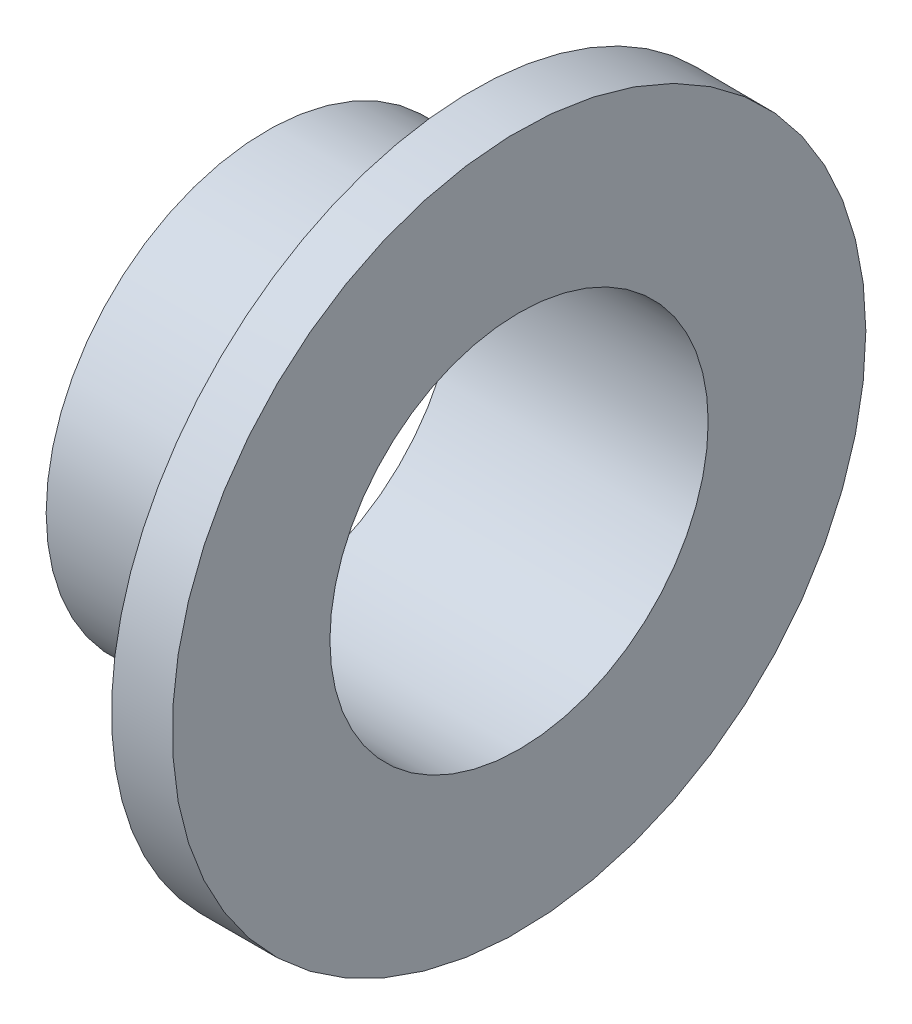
ISO-10303-21;
HEADER;
FILE_DESCRIPTION(('STEP AP214'),'2;1');
FILE_NAME('part.step','',(''),(''),'','','');
FILE_SCHEMA(('AUTOMOTIVE_DESIGN { 1 0 10303 214 1 1 1 1 }'));
ENDSEC;
DATA;
#1=APPLICATION_CONTEXT('core data for automotive mechanical design processes');
#2=APPLICATION_PROTOCOL_DEFINITION('international standard','automotive_design',2000,#1);
#3=PRODUCT_CONTEXT('',#1,'mechanical');
#4=PRODUCT('Part','Part','',(#3));
#5=PRODUCT_RELATED_PRODUCT_CATEGORY('part','',(#4));
#6=PRODUCT_DEFINITION_FORMATION('','',#4);
#7=PRODUCT_DEFINITION_CONTEXT('part definition',#1,'design');
#8=PRODUCT_DEFINITION('design','',#6,#7);
#9=PRODUCT_DEFINITION_SHAPE('','',#8);
#10=(LENGTH_UNIT() NAMED_UNIT(*) SI_UNIT(.MILLI.,.METRE.));
#11=(NAMED_UNIT(*) PLANE_ANGLE_UNIT() SI_UNIT($,.RADIAN.));
#12=(NAMED_UNIT(*) SI_UNIT($,.STERADIAN.) SOLID_ANGLE_UNIT());
#13=UNCERTAINTY_MEASURE_WITH_UNIT(LENGTH_MEASURE(1.E-05),#10,'distance_accuracy_value','');
#14=(GEOMETRIC_REPRESENTATION_CONTEXT(3) GLOBAL_UNCERTAINTY_ASSIGNED_CONTEXT((#13)) GLOBAL_UNIT_ASSIGNED_CONTEXT((#10,
#11,#12)) REPRESENTATION_CONTEXT('',''));
#15=CARTESIAN_POINT('',(0.,0.,0.));
#16=DIRECTION('',(0.,0.,1.));
#17=DIRECTION('',(1.,0.,0.));
#18=AXIS2_PLACEMENT_3D('',#15,#16,#17);
#19=CARTESIAN_POINT('',(25.,132.470854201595,85.6274699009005));
#20=CARTESIAN_POINT('',(14.,-18.7285643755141,-58.4387331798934));
#21=CARTESIAN_POINT('',(13.89,-20.2405585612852,-59.8793952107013));
#22=CARTESIAN_POINT('',(25.,127.69616434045,92.4573147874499));
#23=CARTESIAN_POINT('',(14.,-25.2627996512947,-50.8688078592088));
#24=CARTESIAN_POINT('',(13.89,-26.7923892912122,-52.3020690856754));
#25=CARTESIAN_POINT('',(25.,122.921474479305,99.2871596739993));
#26=CARTESIAN_POINT('',(14.,-31.7970349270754,-43.2988825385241));
#27=CARTESIAN_POINT('',(13.89,-33.3442200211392,-44.7247429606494));
#28=CARTESIAN_POINT('',(25.,113.372094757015,112.946849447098));
#29=CARTESIAN_POINT('',(14.,-44.8655054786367,-28.1590318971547));
#30=CARTESIAN_POINT('',(13.89,-46.4478814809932,-29.5700907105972));
#31=CARTESIAN_POINT('',(25.,108.597404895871,119.776694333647));
#32=CARTESIAN_POINT('',(14.,-51.3997407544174,-20.58910657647));
#33=CARTESIAN_POINT('',(13.89,-52.9997122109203,-21.9927645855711));
#34=CARTESIAN_POINT('',(25.,103.822715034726,126.606539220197));
#35=CARTESIAN_POINT('',(14.,-57.9339760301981,-13.0191812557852));
#36=CARTESIAN_POINT('',(13.89,-59.5515429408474,-14.415438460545));
#37=B_SPLINE_SURFACE_WITH_KNOTS('',3,1,((#19,#20,#21),(#22,#23,#24),(#25,#26,#27),(#28,#29,#30),
(#31,#32,#33),(#34,#35,#36)),.UNSPECIFIED.,.F.,.F.,.F.,(4,2,4),(2,1,2),(0.,0.5,1.),(0.,1.,1.01),.UNSPECIFIED.);
#38=CARTESIAN_POINT('',(16.3608662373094,0.,-11.));
#39=CARTESIAN_POINT('',(16.3484428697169,-0.30880988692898,-11.0000022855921));
#40=CARTESIAN_POINT('',(16.3364586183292,-0.617600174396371,-10.9869906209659));
#41=CARTESIAN_POINT('',(16.3134465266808,-1.23312722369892,-10.9350258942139));
#42=CARTESIAN_POINT('',(16.3024189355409,-1.53986343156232,-10.8960660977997));
#43=CARTESIAN_POINT('',(16.2813919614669,-2.14932265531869,-10.7924079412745));
#44=CARTESIAN_POINT('',(16.2713936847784,-2.45204105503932,-10.7276822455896));
#45=CARTESIAN_POINT('',(16.2525095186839,-3.0509806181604,-10.5729457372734));
#46=CARTESIAN_POINT('',(16.2436236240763,-3.34720181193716,-10.4829350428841));
#47=CARTESIAN_POINT('',(16.2270307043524,-3.93090984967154,-10.2783050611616));
#48=CARTESIAN_POINT('',(16.2193231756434,-4.21840038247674,-10.1636963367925));
#49=CARTESIAN_POINT('',(16.2051365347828,-4.78273537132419,-9.91065434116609));
#50=CARTESIAN_POINT('',(16.1986574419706,-5.0595796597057,-9.77222069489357));
#51=CARTESIAN_POINT('',(16.1869746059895,-5.60057372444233,-9.47254820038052));
#52=CARTESIAN_POINT('',(16.1817705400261,-5.86472670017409,-9.31131514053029));
#53=CARTESIAN_POINT('',(16.1726716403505,-6.37852788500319,-8.96716174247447));
#54=CARTESIAN_POINT('',(16.1687768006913,-6.62817615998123,-8.78424150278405));
#55=CARTESIAN_POINT('',(16.1623252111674,-7.11100799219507,-8.39815701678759));
#56=CARTESIAN_POINT('',(16.1597674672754,-7.34420366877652,-8.19500794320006));
#57=CARTESIAN_POINT('',(16.1560024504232,-7.79267341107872,-7.76979560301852));
#58=CARTESIAN_POINT('',(16.1547951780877,-8.00794746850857,-7.54773232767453));
#59=CARTESIAN_POINT('',(16.153738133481,-8.41904783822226,-7.0862632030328));
#60=CARTESIAN_POINT('',(16.1538884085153,-8.61487347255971,-6.84685674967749));
#61=CARTESIAN_POINT('',(16.1555438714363,-8.98567469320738,-6.35241233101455));
#62=CARTESIAN_POINT('',(16.1570490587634,-9.16065028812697,-6.09737437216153));
#63=CARTESIAN_POINT('',(16.1614007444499,-9.48841568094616,-5.5736298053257));
#64=CARTESIAN_POINT('',(16.1642464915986,-9.64121784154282,-5.30493092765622));
#65=CARTESIAN_POINT('',(16.1712571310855,-9.92366949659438,-4.75564477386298));
#66=CARTESIAN_POINT('',(16.1754220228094,-10.0533190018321,-4.47505750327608));
#67=CARTESIAN_POINT('',(16.1850397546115,-10.2885479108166,-3.90399080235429));
#68=CARTESIAN_POINT('',(16.190492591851,-10.3941273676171,-3.6135113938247));
#69=CARTESIAN_POINT('',(16.2026460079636,-10.5804719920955,-3.02472494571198));
#70=CARTESIAN_POINT('',(16.2093465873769,-10.661237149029,-2.72641790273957));
#71=CARTESIAN_POINT('',(16.2239490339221,-10.7974089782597,-2.12399511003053));
#72=CARTESIAN_POINT('',(16.2318513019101,-10.8528071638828,-1.81987745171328));
#73=CARTESIAN_POINT('',(16.2487982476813,-10.9378194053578,-1.2080911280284));
#74=CARTESIAN_POINT('',(16.2578429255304,-10.967433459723,-0.900422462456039));
#75=CARTESIAN_POINT('',(16.2770096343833,-11.0006755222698,-0.28371762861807));
#76=CARTESIAN_POINT('',(16.2871316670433,-11.0043034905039,0.0253185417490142));
#77=CARTESIAN_POINT('',(16.3083806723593,-10.9855562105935,0.642566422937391));
#78=CARTESIAN_POINT('',(16.3195076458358,-10.9631809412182,0.950778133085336));
#79=CARTESIAN_POINT('',(16.3426995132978,-10.8925573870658,1.56451553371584));
#80=CARTESIAN_POINT('',(16.3547653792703,-10.8442819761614,1.87003806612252));
#81=CARTESIAN_POINT('',(16.3797391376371,-10.7221921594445,2.4759018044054));
#82=CARTESIAN_POINT('',(16.392647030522,-10.6483777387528,2.7762430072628));
#83=CARTESIAN_POINT('',(16.4192136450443,-10.4757410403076,3.36961786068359));
#84=CARTESIAN_POINT('',(16.4328723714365,-10.3769186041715,3.66265146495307));
#85=CARTESIAN_POINT('',(16.4608443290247,-10.1549739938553,4.23933476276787));
#86=CARTESIAN_POINT('',(16.4751575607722,-10.0318517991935,4.52298444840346));
#87=CARTESIAN_POINT('',(16.5043570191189,-9.76201025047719,5.07925619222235));
#88=CARTESIAN_POINT('',(16.5192439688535,-9.61526032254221,5.35186338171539));
#89=CARTESIAN_POINT('',(16.5494686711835,-9.29932527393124,5.88372524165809));
#90=CARTESIAN_POINT('',(16.5648064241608,-9.13014013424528,6.14297990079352));
#91=CARTESIAN_POINT('',(16.5958252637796,-8.77053855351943,6.64630086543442));
#92=CARTESIAN_POINT('',(16.6115063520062,-8.58012201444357,6.89036710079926));
#93=CARTESIAN_POINT('',(16.643102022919,-8.17941192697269,7.36158090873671));
#94=CARTESIAN_POINT('',(16.6590166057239,-7.96911836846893,7.588728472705));
#95=CARTESIAN_POINT('',(16.6909839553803,-7.52992779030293,8.02471343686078));
#96=CARTESIAN_POINT('',(16.7070368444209,-7.30101239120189,8.23353231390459));
#97=CARTESIAN_POINT('',(16.7391526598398,-6.82638787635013,8.63112189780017));
#98=CARTESIAN_POINT('',(16.7552155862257,-6.5806787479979,8.81989258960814));
#99=CARTESIAN_POINT('',(16.7872390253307,-6.0742116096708,9.17604445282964));
#100=CARTESIAN_POINT('',(16.8031995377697,-5.81345355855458,9.34342556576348));
#101=CARTESIAN_POINT('',(16.834906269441,-5.27874106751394,9.65560647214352));
#102=CARTESIAN_POINT('',(16.8506524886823,-5.00478662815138,9.80040626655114));
#103=CARTESIAN_POINT('',(16.8818243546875,-4.4455520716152,10.0664278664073));
#104=CARTESIAN_POINT('',(16.897249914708,-4.16026894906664,10.1876433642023));
#105=CARTESIAN_POINT('',(16.9276676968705,-3.58047316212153,10.4055815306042));
#106=CARTESIAN_POINT('',(16.9426599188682,-3.28596049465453,10.5023041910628));
#107=CARTESIAN_POINT('',(16.9721053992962,-2.68979999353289,10.6705625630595));
#108=CARTESIAN_POINT('',(16.9865586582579,-2.38815216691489,10.7420982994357));
#109=CARTESIAN_POINT('',(17.0148241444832,-1.77986726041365,10.8594667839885));
#110=CARTESIAN_POINT('',(17.0286363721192,-1.47323018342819,10.9052995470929));
#111=CARTESIAN_POINT('',(17.0555141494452,-0.857328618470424,10.970908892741));
#112=CARTESIAN_POINT('',(17.0685801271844,-0.548065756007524,10.9907005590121));
#113=CARTESIAN_POINT('',(17.0938812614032,0.0710614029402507,11.0041276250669));
#114=CARTESIAN_POINT('',(17.1061164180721,0.380925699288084,10.9977630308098));
#115=CARTESIAN_POINT('',(17.1296686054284,0.999046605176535,10.958914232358));
#116=CARTESIAN_POINT('',(17.140985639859,1.30730322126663,10.9264301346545));
#117=CARTESIAN_POINT('',(17.1626205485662,1.92001131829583,10.8355651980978));
#118=CARTESIAN_POINT('',(17.1729384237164,2.22446280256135,10.777184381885));
#119=CARTESIAN_POINT('',(17.1924891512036,2.82703095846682,10.6350180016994));
#120=CARTESIAN_POINT('',(17.2017232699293,3.12515468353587,10.5512625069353));
#121=CARTESIAN_POINT('',(17.2190538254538,3.71331206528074,10.3589113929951));
#122=CARTESIAN_POINT('',(17.2271502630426,4.0033457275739,10.2503157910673));
#123=CARTESIAN_POINT('',(17.2421464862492,4.5732518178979,10.0090517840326));
#124=CARTESIAN_POINT('',(17.2490462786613,4.85312430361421,9.87638351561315));
#125=CARTESIAN_POINT('',(17.2615986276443,5.40071115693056,9.58791350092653));
#126=CARTESIAN_POINT('',(17.2672511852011,5.66842553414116,9.43211177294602));
#127=CARTESIAN_POINT('',(17.2772607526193,6.18945077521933,9.09869418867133));
#128=CARTESIAN_POINT('',(17.2816194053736,6.44277957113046,8.92110640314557));
#129=CARTESIAN_POINT('',(17.2890181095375,6.93359616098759,8.54522040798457));
#130=CARTESIAN_POINT('',(17.2920581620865,7.17108396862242,8.34692221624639));
#131=CARTESIAN_POINT('',(17.2967962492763,7.62852449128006,7.93102573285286));
#132=CARTESIAN_POINT('',(17.2984942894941,7.84847727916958,7.71342752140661));
#133=CARTESIAN_POINT('',(17.3005345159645,8.26928097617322,7.26047874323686));
#134=CARTESIAN_POINT('',(17.3008767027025,8.47013189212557,7.02512818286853));
#135=CARTESIAN_POINT('',(17.300201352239,8.8511456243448,6.53854924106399));
#136=CARTESIAN_POINT('',(17.2991849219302,9.03132515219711,6.28733394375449));
#137=CARTESIAN_POINT('',(17.2957999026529,9.36990444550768,5.77064056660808));
#138=CARTESIAN_POINT('',(17.2934313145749,9.52830422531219,5.50516249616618));
#139=CARTESIAN_POINT('',(17.2873573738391,9.82219969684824,4.961833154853));
#140=CARTESIAN_POINT('',(17.2836520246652,9.9576954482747,4.68398191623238));
#141=CARTESIAN_POINT('',(17.27492963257,10.2048238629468,4.11788237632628));
#142=CARTESIAN_POINT('',(17.2699125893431,10.3164565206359,3.8296340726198));
#143=CARTESIAN_POINT('',(17.2586013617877,10.515071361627,3.24478788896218));
#144=CARTESIAN_POINT('',(17.2523071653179,10.6020533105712,2.9481899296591));
#145=CARTESIAN_POINT('',(17.2384855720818,10.750753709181,2.348755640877));
#146=CARTESIAN_POINT('',(17.2309581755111,10.8124721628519,2.04591931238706));
#147=CARTESIAN_POINT('',(17.2147230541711,10.9102149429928,1.43615835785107));
#148=CARTESIAN_POINT('',(17.2060153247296,10.9462391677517,1.12923371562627));
#149=CARTESIAN_POINT('',(17.1874810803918,10.9923456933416,0.513475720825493));
#150=CARTESIAN_POINT('',(17.1776545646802,11.0024279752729,0.204642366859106));
#151=CARTESIAN_POINT('',(17.1569437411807,10.9965853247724,-0.413002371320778));
#152=CARTESIAN_POINT('',(17.1460585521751,10.9806385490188,-0.721813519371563));
#153=CARTESIAN_POINT('',(17.1233148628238,10.9228187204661,-1.33696272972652));
#154=CARTESIAN_POINT('',(17.1114563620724,10.8809456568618,-1.64330079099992));
#155=CARTESIAN_POINT('',(17.0868506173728,10.7715788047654,-2.25133454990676));
#156=CARTESIAN_POINT('',(17.0741033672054,10.7040848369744,-2.55303021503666));
#157=CARTESIAN_POINT('',(17.0478113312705,10.5439631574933,-3.1496407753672));
#158=CARTESIAN_POINT('',(17.0342665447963,10.4513354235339,-3.44455566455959));
#159=CARTESIAN_POINT('',(17.0064578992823,10.2414706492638,-4.02590462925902));
#160=CARTESIAN_POINT('',(16.9921931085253,10.1242010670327,-4.31232691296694));
#161=CARTESIAN_POINT('',(16.9630635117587,9.86596621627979,-4.87425090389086));
#162=CARTESIAN_POINT('',(16.9481987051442,9.72500092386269,-5.14975260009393));
#163=CARTESIAN_POINT('',(16.917976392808,9.42038557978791,-5.68787516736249));
#164=CARTESIAN_POINT('',(16.9026189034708,9.25673628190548,-5.95049646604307));
#165=CARTESIAN_POINT('',(16.8715211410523,8.90791438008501,-6.46100893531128));
#166=CARTESIAN_POINT('',(16.8557808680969,8.72274178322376,-6.70890011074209));
#167=CARTESIAN_POINT('',(16.824013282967,8.33197495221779,-7.18846068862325));
#168=CARTESIAN_POINT('',(16.8079856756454,8.1263586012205,-7.42011205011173));
#169=CARTESIAN_POINT('',(16.7757756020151,7.69633491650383,-7.86525251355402));
#170=CARTESIAN_POINT('',(16.7595931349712,7.4719274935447,-8.07874152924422));
#171=CARTESIAN_POINT('',(16.7271857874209,7.00585617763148,-8.48609411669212));
#172=CARTESIAN_POINT('',(16.7109608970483,6.764187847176,-8.6799526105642));
#173=CARTESIAN_POINT('',(16.6785900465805,6.26536646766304,-9.04660132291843));
#174=CARTESIAN_POINT('',(16.6624440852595,6.00821365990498,-9.21939186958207));
#175=CARTESIAN_POINT('',(16.6303304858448,5.47997115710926,-9.54284706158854));
#176=CARTESIAN_POINT('',(16.6143630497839,5.20886730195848,-9.69348860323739));
#177=CARTESIAN_POINT('',(16.5827388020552,4.65489732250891,-9.97135686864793));
#178=CARTESIAN_POINT('',(16.5670819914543,4.372031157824,-10.098583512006));
#179=CARTESIAN_POINT('',(16.5362082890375,3.79685218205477,-10.3285882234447));
#180=CARTESIAN_POINT('',(16.5209909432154,3.50454983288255,-10.4313923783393));
#181=CARTESIAN_POINT('',(16.4910931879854,2.91238933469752,-10.6119650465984));
#182=CARTESIAN_POINT('',(16.4764126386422,2.61253318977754,-10.6897401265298));
#183=CARTESIAN_POINT('',(16.4440560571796,1.93074786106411,-10.8361673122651));
#184=CARTESIAN_POINT('',(16.4265605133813,1.5472266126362,-10.8975476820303));
#185=CARTESIAN_POINT('',(16.3927677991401,0.77579326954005,-10.9794625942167));
#186=CARTESIAN_POINT('',(16.3764706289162,0.387881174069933,-10.9999971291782));
#187=CARTESIAN_POINT('',(16.3608662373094,0.,-11.));
#188=B_SPLINE_CURVE_WITH_KNOTS('',3,(#38,#39,#40,#41,#42,#43,#44,#45,#46,#47,#48,#49,#50,#51,
#52,#53,#54,#55,#56,#57,#58,#59,#60,#61,#62,#63,#64,#65,#66,#67,#68,#69,#70,#71,#72,#73,#74,#75,
#76,#77,#78,#79,#80,#81,#82,#83,#84,#85,#86,#87,#88,#89,#90,#91,#92,#93,#94,#95,#96,#97,#98,#99,
#100,#101,#102,#103,#104,#105,#106,#107,#108,#109,#110,#111,#112,#113,#114,#115,#116,#117,#118,
#119,#120,#121,#122,#123,#124,#125,#126,#127,#128,#129,#130,#131,#132,#133,#134,#135,#136,#137,
#138,#139,#140,#141,#142,#143,#144,#145,#146,#147,#148,#149,#150,#151,#152,#153,#154,#155,#156,
#157,#158,#159,#160,#161,#162,#163,#164,#165,#166,#167,#168,#169,#170,#171,#172,#173,#174,#175,
#176,#177,#178,#179,#180,#181,#182,#183,#184,#185,#186,#187),.UNSPECIFIED.,.T.,.F.,(4,2,2,2,2,2,
2,2,2,2,2,2,2,2,2,2,2,2,2,2,2,2,2,2,2,2,2,2,2,2,2,2,2,2,2,2,2,2,2,2,2,2,2,2,2,2,2,2,2,2,2,2,2,2,
2,2,2,2,2,2,2,2,2,2,2,2,2,2,2,2,2,2,2,2,4),(0.,0.926840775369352,1.85392218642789,
2.78198978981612,3.71005305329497,4.63771857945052,5.56539870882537,6.49284373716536,
7.42028455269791,8.34703490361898,9.27378568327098,10.2005687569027,11.1273514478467,
12.053615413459,12.9798789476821,13.9061404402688,14.8324023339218,15.7589738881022,
16.6855454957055,17.6121185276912,18.5386923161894,19.4662384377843,20.3937850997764,
21.3213376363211,22.2488909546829,23.1776543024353,24.1064184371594,25.0351868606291,
25.9639557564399,26.893652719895,27.8233503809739,28.7530505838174,29.6827507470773,
30.6126992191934,31.5426480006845,32.4725958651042,33.4025431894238,34.3319516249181,
35.2613598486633,36.1907642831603,37.1201679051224,38.0484744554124,38.9767803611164,
39.9050809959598,40.8333808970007,41.7604970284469,42.6876123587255,43.6147238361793,
44.5418349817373,45.4681912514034,46.3945469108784,47.3209001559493,48.2472536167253,
49.1736158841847,50.0999780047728,51.0263437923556,51.9527102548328,52.8798545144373,
53.8069991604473,54.7341502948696,55.6613022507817,56.5896863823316,57.5180714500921,
58.4464256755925,59.3747795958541,60.3041490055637,61.2335228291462,62.1631364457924,
63.0927355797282,64.0232976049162,64.9538628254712,65.8834295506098,66.8127521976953,
67.9769118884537,69.1410717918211),.UNSPECIFIED.);
#189=CARTESIAN_POINT('',(16.3608662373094,0.,-11.));
#190=VERTEX_POINT('',#189);
#191=EDGE_CURVE('E48',#190,#190,#188,.T.);
#192=CARTESIAN_POINT('',(17.0091308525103,1.35831612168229,6.86694818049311));
#193=CARTESIAN_POINT('',(17.0026284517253,1.16519210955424,6.90515215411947));
#194=CARTESIAN_POINT('',(16.9957949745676,0.970507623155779,6.9351906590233));
#195=CARTESIAN_POINT('',(16.9815104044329,0.57926314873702,6.9787667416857));
#196=CARTESIAN_POINT('',(16.9740591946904,0.382702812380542,6.99230119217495));
#197=CARTESIAN_POINT('',(16.9585896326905,-0.0109490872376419,7.00276219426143));
#198=CARTESIAN_POINT('',(16.9505709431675,-0.208040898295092,6.99967878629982));
#199=CARTESIAN_POINT('',(16.9340242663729,-0.601314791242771,6.97690675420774));
#200=CARTESIAN_POINT('',(16.9254960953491,-0.797496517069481,6.95721210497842));
#201=CARTESIAN_POINT('',(16.908000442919,-1.18733152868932,6.9013757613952));
#202=CARTESIAN_POINT('',(16.8990333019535,-1.38098663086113,6.86524663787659));
#203=CARTESIAN_POINT('',(16.8807137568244,-1.76461823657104,6.77679023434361));
#204=CARTESIAN_POINT('',(16.8713612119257,-1.95459335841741,6.72445699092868));
#205=CARTESIAN_POINT('',(16.8523452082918,-2.32934138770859,6.60400515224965));
#206=CARTESIAN_POINT('',(16.8426819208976,-2.51411706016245,6.53589513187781));
#207=CARTESIAN_POINT('',(16.8231040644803,-2.8773316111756,6.38433246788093));
#208=CARTESIAN_POINT('',(16.8131894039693,-3.05576812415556,6.30087416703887));
#209=CARTESIAN_POINT('',(16.7931765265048,-3.40506385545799,6.11917616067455));
#210=CARTESIAN_POINT('',(16.7830782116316,-3.5759188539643,6.02092835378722));
#211=CARTESIAN_POINT('',(16.7627706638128,-3.90879649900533,5.81034529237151));
#212=CARTESIAN_POINT('',(16.7525613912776,-4.0708158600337,5.69800484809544));
#213=CARTESIAN_POINT('',(16.7321109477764,-4.38475038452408,5.46010428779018));
#214=CARTESIAN_POINT('',(16.7218697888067,-4.53666895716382,5.33454866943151));
#215=CARTESIAN_POINT('',(16.7014203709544,-4.82943777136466,5.07102890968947));
#216=CARTESIAN_POINT('',(16.6912121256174,-4.97028390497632,4.93306020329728));
#217=CARTESIAN_POINT('',(16.6709023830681,-5.23986836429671,4.64570749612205));
#218=CARTESIAN_POINT('',(16.6608009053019,-5.36860451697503,4.49632145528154));
#219=CARTESIAN_POINT('',(16.6407740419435,-5.61306924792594,4.18715948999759));
#220=CARTESIAN_POINT('',(16.6308487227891,-5.72879300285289,4.02737974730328));
#221=CARTESIAN_POINT('',(16.6112516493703,-5.94631230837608,3.69867461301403));
#222=CARTESIAN_POINT('',(16.6015798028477,-6.04811298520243,3.52975261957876));
#223=CARTESIAN_POINT('',(16.5825508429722,-6.23714418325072,3.18384971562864));
#224=CARTESIAN_POINT('',(16.5731938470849,-6.32436931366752,3.00686585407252));
#225=CARTESIAN_POINT('',(16.5548700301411,-6.48352682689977,2.64625686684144));
#226=CARTESIAN_POINT('',(16.5459029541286,-6.55546932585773,2.4626362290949));
#227=CARTESIAN_POINT('',(16.5284151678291,-6.68363834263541,2.08994855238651));
#228=CARTESIAN_POINT('',(16.519894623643,-6.73985904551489,1.90087952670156));
#229=CARTESIAN_POINT('',(16.4951027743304,-6.88420249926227,1.32764046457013));
#230=CARTESIAN_POINT('',(16.4795812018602,-6.94818049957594,0.937043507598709));
#231=CARTESIAN_POINT('',(16.4510416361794,-7.00946161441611,0.151178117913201));
#232=CARTESIAN_POINT('',(16.4380210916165,-7.00683304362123,-0.244085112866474));
#233=CARTESIAN_POINT('',(16.4148246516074,-6.93519139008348,-1.02868929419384));
#234=CARTESIAN_POINT('',(16.4046487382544,-6.86617872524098,-1.41803028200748));
#235=CARTESIAN_POINT('',(16.3874502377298,-6.66380582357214,-2.17912390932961));
#236=CARTESIAN_POINT('',(16.3804235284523,-6.53053018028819,-2.55089896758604));
#237=CARTESIAN_POINT('',(16.3697082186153,-6.20343567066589,-3.26684232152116));
#238=CARTESIAN_POINT('',(16.3660195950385,-6.00961722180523,-3.6110108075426));
#239=CARTESIAN_POINT('',(16.3620931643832,-5.56717080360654,-4.26159861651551));
#240=CARTESIAN_POINT('',(16.3618518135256,-5.3185993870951,-4.56805638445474));
#241=CARTESIAN_POINT('',(16.3648235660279,-4.77357410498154,-5.13493460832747));
#242=CARTESIAN_POINT('',(16.3680366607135,-4.47712035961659,-5.3953551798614));
#243=CARTESIAN_POINT('',(16.3778266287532,-3.84492327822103,-5.86269037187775));
#244=CARTESIAN_POINT('',(16.3844025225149,-3.50919140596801,-6.06962054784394));
#245=CARTESIAN_POINT('',(16.400742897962,-2.80764061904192,-6.42428329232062));
#246=CARTESIAN_POINT('',(16.4105073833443,-2.44182166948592,-6.5720157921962));
#247=CARTESIAN_POINT('',(16.427323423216,-1.87874917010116,-6.74604614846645));
#248=CARTESIAN_POINT('',(16.43329613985,-1.68850497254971,-6.7961498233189));
#249=CARTESIAN_POINT('',(16.4459243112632,-1.3045175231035,-6.88017338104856));
#250=CARTESIAN_POINT('',(16.4525795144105,-1.11077558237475,-6.9140992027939));
#251=CARTESIAN_POINT('',(16.4665284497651,-0.721087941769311,-6.96553609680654));
#252=CARTESIAN_POINT('',(16.4738224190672,-0.525141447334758,-6.98304104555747));
#253=CARTESIAN_POINT('',(16.4889924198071,-0.132561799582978,-7.00150136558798));
#254=CARTESIAN_POINT('',(16.4968682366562,0.0640710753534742,-7.00246280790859));
#255=CARTESIAN_POINT('',(16.5131609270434,0.457006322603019,-6.98783663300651));
#256=CARTESIAN_POINT('',(16.5215786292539,0.653307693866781,-6.97222307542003));
#257=CARTESIAN_POINT('',(16.5388807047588,1.04380608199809,-6.92453211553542));
#258=CARTESIAN_POINT('',(16.5477649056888,1.23800384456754,-6.89246075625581));
#259=CARTESIAN_POINT('',(16.5659428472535,1.62306520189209,-6.81207440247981));
#260=CARTESIAN_POINT('',(16.5752367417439,1.8139275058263,-6.76375325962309));
#261=CARTESIAN_POINT('',(16.5941610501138,2.19082072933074,-6.65123804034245));
#262=CARTESIAN_POINT('',(16.6037913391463,2.37685339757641,-6.58704980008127));
#263=CARTESIAN_POINT('',(16.6233394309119,2.74315335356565,-6.4431279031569));
#264=CARTESIAN_POINT('',(16.6332576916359,2.92341037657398,-6.36336818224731));
#265=CARTESIAN_POINT('',(16.6532913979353,3.27648500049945,-6.18897412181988));
#266=CARTESIAN_POINT('',(16.6634067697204,3.44930531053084,-6.09434525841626));
#267=CARTESIAN_POINT('',(16.683769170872,3.78640700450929,-5.89083172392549));
#268=CARTESIAN_POINT('',(16.6940162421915,3.95068557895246,-5.78194240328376));
#269=CARTESIAN_POINT('',(16.7145615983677,4.26941864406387,-5.550748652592));
#270=CARTESIAN_POINT('',(16.7248598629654,4.42387673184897,-5.42844917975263));
#271=CARTESIAN_POINT('',(16.7454488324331,4.72210156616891,-5.17113010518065));
#272=CARTESIAN_POINT('',(16.7557395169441,4.86585651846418,-5.03609683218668));
#273=CARTESIAN_POINT('',(16.7762244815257,5.14141613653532,-4.75443400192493));
#274=CARTESIAN_POINT('',(16.7864187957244,5.27322518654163,-4.60780873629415));
#275=CARTESIAN_POINT('',(16.8066480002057,5.52409219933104,-4.30386547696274));
#276=CARTESIAN_POINT('',(16.8166827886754,5.64314227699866,-4.1465409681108));
#277=CARTESIAN_POINT('',(16.8365110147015,5.86751028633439,-3.82245379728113));
#278=CARTESIAN_POINT('',(16.8463045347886,5.97283296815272,-3.65569442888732));
#279=CARTESIAN_POINT('',(16.8655895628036,6.1691038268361,-3.31376544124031));
#280=CARTESIAN_POINT('',(16.8750808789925,6.26004301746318,-3.13859065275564));
#281=CARTESIAN_POINT('',(16.8936864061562,6.42681176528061,-2.78118263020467));
#282=CARTESIAN_POINT('',(16.9028006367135,6.50264210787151,-2.59894976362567));
#283=CARTESIAN_POINT('',(16.9205770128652,6.63857748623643,-2.22892219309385));
#284=CARTESIAN_POINT('',(16.9292396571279,6.69870017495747,-2.04113399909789));
#285=CARTESIAN_POINT('',(16.946061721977,6.80289947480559,-1.66113650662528));
#286=CARTESIAN_POINT('',(16.9542211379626,6.84697593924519,-1.46892716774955));
#287=CARTESIAN_POINT('',(16.9706466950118,6.92180788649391,-1.06501653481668));
#288=CARTESIAN_POINT('',(16.9788632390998,6.95111724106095,-0.853044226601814));
#289=CARTESIAN_POINT('',(16.9945624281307,6.99020757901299,-0.427370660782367));
#290=CARTESIAN_POINT('',(17.0020454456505,6.9999985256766,-0.213670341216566));
#291=CARTESIAN_POINT('',(17.0136916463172,7.00000094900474,0.137537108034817));
#292=CARTESIAN_POINT('',(17.018087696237,6.99594578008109,0.275061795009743));
#293=CARTESIAN_POINT('',(17.0265392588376,6.97973705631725,0.549734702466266));
#294=CARTESIAN_POINT('',(17.0305945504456,6.96757828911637,0.686882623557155));
#295=CARTESIAN_POINT('',(17.0400077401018,6.92825357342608,1.01879121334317));
#296=CARTESIAN_POINT('',(17.0451798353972,6.89689088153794,1.21307432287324));
#297=CARTESIAN_POINT('',(17.0547584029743,6.8179037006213,1.59840386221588));
#298=CARTESIAN_POINT('',(17.0591645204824,6.77027170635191,1.78944875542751));
#299=CARTESIAN_POINT('',(17.0671832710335,6.6590042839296,2.16713391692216));
#300=CARTESIAN_POINT('',(17.0707947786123,6.5953464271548,2.35376760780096));
#301=CARTESIAN_POINT('',(17.0771919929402,6.45248470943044,2.72108240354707));
#302=CARTESIAN_POINT('',(17.0799773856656,6.37327495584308,2.90176122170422));
#303=CARTESIAN_POINT('',(17.0846953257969,6.20009934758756,3.25536951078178));
#304=CARTESIAN_POINT('',(17.0866299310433,6.10616985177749,3.42831676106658));
#305=CARTESIAN_POINT('',(17.0896435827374,5.90403710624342,3.76577309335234));
#306=CARTESIAN_POINT('',(17.0907222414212,5.79582741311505,3.93027831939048));
#307=CARTESIAN_POINT('',(17.0920152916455,5.56596555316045,4.24955423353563));
#308=CARTESIAN_POINT('',(17.0922298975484,5.4443167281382,4.4043273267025));
#309=CARTESIAN_POINT('',(17.0917946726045,5.18847890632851,4.70301350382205));
#310=CARTESIAN_POINT('',(17.0911452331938,5.05429561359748,4.84693147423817));
#311=CARTESIAN_POINT('',(17.0889875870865,4.77425363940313,5.12300431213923));
#312=CARTESIAN_POINT('',(17.0874791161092,4.62839137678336,5.25515554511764));
#313=CARTESIAN_POINT('',(17.0836154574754,4.32612421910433,5.50665891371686));
#314=CARTESIAN_POINT('',(17.0812605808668,4.16972321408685,5.62601573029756));
#315=CARTESIAN_POINT('',(17.0757227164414,3.84751952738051,5.85108402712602));
#316=CARTESIAN_POINT('',(17.072540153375,3.68172170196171,5.95680246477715));
#317=CARTESIAN_POINT('',(17.06537115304,3.3418900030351,6.153890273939));
#318=CARTESIAN_POINT('',(17.0613848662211,3.16785767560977,6.24526232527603));
#319=CARTESIAN_POINT('',(17.0506143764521,2.73068605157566,6.4517988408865));
#320=CARTESIAN_POINT('',(17.0433880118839,2.46349523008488,6.55847818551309));
#321=CARTESIAN_POINT('',(17.0273859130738,1.91808038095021,6.73820542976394));
#322=CARTESIAN_POINT('',(17.0186101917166,1.63985644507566,6.81125360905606));
#323=CARTESIAN_POINT('',(17.0091308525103,1.35831612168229,6.86694818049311));
#324=B_SPLINE_CURVE_WITH_KNOTS('',3,(#192,#193,#194,#195,#196,#197,#198,#199,#200,#201,#202,
#203,#204,#205,#206,#207,#208,#209,#210,#211,#212,#213,#214,#215,#216,#217,#218,#219,#220,#221,
#222,#223,#224,#225,#226,#227,#228,#229,#230,#231,#232,#233,#234,#235,#236,#237,#238,#239,#240,
#241,#242,#243,#244,#245,#246,#247,#248,#249,#250,#251,#252,#253,#254,#255,#256,#257,#258,#259,
#260,#261,#262,#263,#264,#265,#266,#267,#268,#269,#270,#271,#272,#273,#274,#275,#276,#277,#278,
#279,#280,#281,#282,#283,#284,#285,#286,#287,#288,#289,#290,#291,#292,#293,#294,#295,#296,#297,
#298,#299,#300,#301,#302,#303,#304,#305,#306,#307,#308,#309,#310,#311,#312,#313,#314,#315,#316,
#317,#318,#319,#320,#321,#322,#323),.UNSPECIFIED.,.T.,.F.,(4,2,2,2,2,2,2,2,2,2,2,2,2,2,2,2,2,2,
2,2,2,2,2,2,2,2,2,2,2,2,2,2,2,2,2,2,2,2,2,2,2,2,2,2,2,2,2,2,2,2,2,2,2,2,2,2,2,2,2,2,2,2,2,2,2,
4),(0.,0.590672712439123,1.18145733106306,1.77259606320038,2.36394930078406,2.95485096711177,
3.54597035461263,4.13676921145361,4.72778626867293,5.31912825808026,5.91068865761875,
6.50204837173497,7.09362645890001,7.68531049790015,8.27721314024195,8.86889726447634,
9.4607997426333,10.0523091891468,10.6440371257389,11.8262133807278,13.0071771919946,
14.1881335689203,15.3675396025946,16.546937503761,17.7251229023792,18.9033053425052,
20.0811447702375,21.2589855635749,21.8488788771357,22.4385554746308,23.0284518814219,
23.6181318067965,24.2087359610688,24.799123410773,25.3897344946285,25.9801286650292,
26.57151967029,27.1626933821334,27.7540603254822,28.345209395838,28.9370005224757,
29.5285735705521,30.1205101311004,30.7122413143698,31.3043407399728,31.8964093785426,
32.4878097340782,33.0792154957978,33.7207597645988,34.3619764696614,34.7747201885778,
35.1877296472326,35.7775935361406,36.3677299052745,36.9586968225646,37.5498880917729,
38.1396414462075,38.7296618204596,39.3195358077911,39.9091426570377,40.4989309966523,
41.0885028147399,41.6777726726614,42.2669323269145,43.1280348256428,43.9891301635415),.UNSPECIFIED.);
#325=CARTESIAN_POINT('',(17.0091308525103,1.35831612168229,6.86694818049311));
#326=VERTEX_POINT('',#325);
#327=EDGE_CURVE('E44',#326,#326,#324,.T.);
#328=ORIENTED_EDGE('',*,*,#191,.T.);
#329=EDGE_LOOP('',(#328));
#330=FACE_BOUND('',#329,.T.);
#331=ORIENTED_EDGE('',*,*,#327,.T.);
#332=EDGE_LOOP('',(#331));
#333=FACE_BOUND('',#332,.T.);
#334=ADVANCED_FACE('F33',(#330,#333),#37,.F.);
#335=CARTESIAN_POINT('',(0.,0.,0.));
#336=DIRECTION('',(-1.,0.,0.));
#337=DIRECTION('',(0.,0.,1.));
#338=AXIS2_PLACEMENT_3D('',#335,#336,#337);
#339=CYLINDRICAL_SURFACE('',#338,6.99999999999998);
#340=CARTESIAN_POINT('',(11.0091308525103,0.,0.));
#341=DIRECTION('',(-1.,0.,0.));
#342=DIRECTION('',(0.,0.,1.));
#343=AXIS2_PLACEMENT_3D('',#340,#341,#342);
#344=CIRCLE('',#343,6.99999999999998);
#345=CARTESIAN_POINT('',(11.0091308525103,0.,6.99999999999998));
#346=VERTEX_POINT('',#345);
#347=EDGE_CURVE('E10',#346,#346,#344,.T.);
#348=ORIENTED_EDGE('',*,*,#347,.F.);
#349=EDGE_LOOP('',(#348));
#350=FACE_BOUND('',#349,.T.);
#351=ORIENTED_EDGE('',*,*,#327,.F.);
#352=EDGE_LOOP('',(#351));
#353=FACE_BOUND('',#352,.T.);
#354=ADVANCED_FACE('F58',(#350,#353),#339,.T.);
#355=CARTESIAN_POINT('',(0.,0.,0.));
#356=DIRECTION('',(-1.,0.,0.));
#357=DIRECTION('',(0.,0.,1.));
#358=AXIS2_PLACEMENT_3D('',#355,#356,#357);
#359=CYLINDRICAL_SURFACE('',#358,6.);
#360=CARTESIAN_POINT('',(11.0091308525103,0.,0.));
#361=DIRECTION('',(-1.,0.,0.));
#362=DIRECTION('',(0.,0.,1.));
#363=AXIS2_PLACEMENT_3D('',#360,#361,#362);
#364=CIRCLE('',#363,6.);
#365=CARTESIAN_POINT('',(11.0091308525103,0.,6.));
#366=VERTEX_POINT('',#365);
#367=EDGE_CURVE('E40',#366,#366,#364,.T.);
#368=ORIENTED_EDGE('',*,*,#367,.T.);
#369=EDGE_LOOP('',(#368));
#370=FACE_BOUND('',#369,.T.);
#371=CARTESIAN_POINT('',(19.0091308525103,0.,0.));
#372=DIRECTION('',(1.,0.,0.));
#373=DIRECTION('',(0.,0.,-1.));
#374=AXIS2_PLACEMENT_3D('',#371,#372,#373);
#375=CIRCLE('',#374,6.);
#376=CARTESIAN_POINT('',(19.0091308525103,0.,-6.));
#377=VERTEX_POINT('',#376);
#378=EDGE_CURVE('E91',#377,#377,#375,.F.);
#379=ORIENTED_EDGE('',*,*,#378,.F.);
#380=EDGE_LOOP('',(#379));
#381=FACE_BOUND('',#380,.T.);
#382=ADVANCED_FACE('F80',(#370,#381),#359,.F.);
#383=CARTESIAN_POINT('',(11.0091308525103,6.,0.));
#384=DIRECTION('',(1.,0.,0.));
#385=DIRECTION('',(0.,0.,-1.));
#386=AXIS2_PLACEMENT_3D('',#383,#384,#385);
#387=PLANE('',#386);
#388=ORIENTED_EDGE('',*,*,#367,.F.);
#389=EDGE_LOOP('',(#388));
#390=FACE_BOUND('',#389,.T.);
#391=ORIENTED_EDGE('',*,*,#347,.T.);
#392=EDGE_LOOP('',(#391));
#393=FACE_BOUND('',#392,.T.);
#394=ADVANCED_FACE('F35',(#390,#393),#387,.F.);
#395=CARTESIAN_POINT('',(11.0081308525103,0.,0.));
#396=DIRECTION('',(1.,0.,0.));
#397=DIRECTION('',(0.,0.,-1.));
#398=AXIS2_PLACEMENT_3D('',#395,#396,#397);
#399=CYLINDRICAL_SURFACE('',#398,11.);
#400=ORIENTED_EDGE('',*,*,#191,.F.);
#401=EDGE_LOOP('',(#400));
#402=FACE_BOUND('',#401,.T.);
#403=CARTESIAN_POINT('',(19.0091308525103,0.,0.));
#404=DIRECTION('',(1.,0.,0.));
#405=DIRECTION('',(0.,0.,-1.));
#406=AXIS2_PLACEMENT_3D('',#403,#404,#405);
#407=CIRCLE('',#406,11.);
#408=CARTESIAN_POINT('',(19.0091308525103,0.,-11.));
#409=VERTEX_POINT('',#408);
#410=EDGE_CURVE('E93',#409,#409,#407,.T.);
#411=ORIENTED_EDGE('',*,*,#410,.F.);
#412=EDGE_LOOP('',(#411));
#413=FACE_BOUND('',#412,.T.);
#414=ADVANCED_FACE('F75',(#402,#413),#399,.T.);
#415=CARTESIAN_POINT('',(19.0091308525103,0.,0.));
#416=DIRECTION('',(1.,0.,0.));
#417=DIRECTION('',(0.,0.,-1.));
#418=AXIS2_PLACEMENT_3D('',#415,#416,#417);
#419=PLANE('',#418);
#420=ORIENTED_EDGE('',*,*,#410,.T.);
#421=EDGE_LOOP('',(#420));
#422=FACE_BOUND('',#421,.T.);
#423=ORIENTED_EDGE('',*,*,#378,.T.);
#424=EDGE_LOOP('',(#423));
#425=FACE_BOUND('',#424,.T.);
#426=ADVANCED_FACE('F67',(#422,#425),#419,.T.);
#427=CLOSED_SHELL('',(#334,#354,#382,#394,#414,#426));
#428=MANIFOLD_SOLID_BREP('B2',#427);
#429=ADVANCED_BREP_SHAPE_REPRESENTATION('',(#18,#428),#14);
#430=SHAPE_DEFINITION_REPRESENTATION(#9,#429);
ENDSEC;
END-ISO-10303-21;
